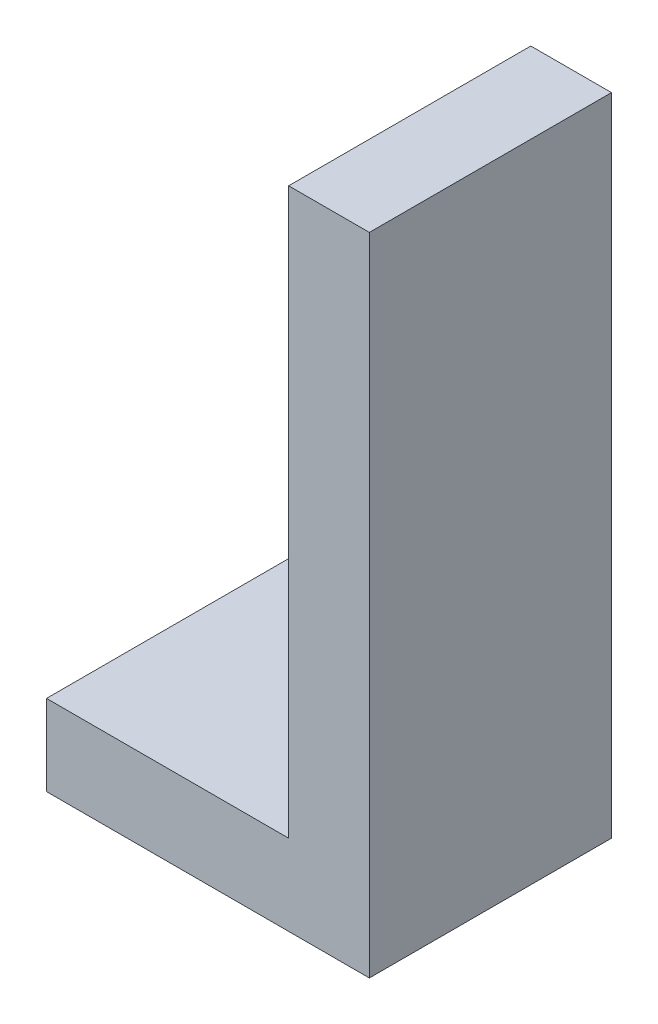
ISO-10303-21;
HEADER;
FILE_DESCRIPTION(('STEP AP214'),'2;1');
FILE_NAME('part.step','',(''),(''),'','','');
FILE_SCHEMA(('AUTOMOTIVE_DESIGN { 1 0 10303 214 1 1 1 1 }'));
ENDSEC;
DATA;
#1=APPLICATION_CONTEXT('core data for automotive mechanical design processes');
#2=APPLICATION_PROTOCOL_DEFINITION('international standard','automotive_design',2000,#1);
#3=PRODUCT_CONTEXT('',#1,'mechanical');
#4=PRODUCT('Part','Part','',(#3));
#5=PRODUCT_RELATED_PRODUCT_CATEGORY('part','',(#4));
#6=PRODUCT_DEFINITION_FORMATION('','',#4);
#7=PRODUCT_DEFINITION_CONTEXT('part definition',#1,'design');
#8=PRODUCT_DEFINITION('design','',#6,#7);
#9=PRODUCT_DEFINITION_SHAPE('','',#8);
#10=(LENGTH_UNIT() NAMED_UNIT(*) SI_UNIT(.MILLI.,.METRE.));
#11=(NAMED_UNIT(*) PLANE_ANGLE_UNIT() SI_UNIT($,.RADIAN.));
#12=(NAMED_UNIT(*) SI_UNIT($,.STERADIAN.) SOLID_ANGLE_UNIT());
#13=UNCERTAINTY_MEASURE_WITH_UNIT(LENGTH_MEASURE(1.E-05),#10,'distance_accuracy_value','');
#14=(GEOMETRIC_REPRESENTATION_CONTEXT(3) GLOBAL_UNCERTAINTY_ASSIGNED_CONTEXT((#13)) GLOBAL_UNIT_ASSIGNED_CONTEXT((#10,
#11,#12)) REPRESENTATION_CONTEXT('',''));
#15=CARTESIAN_POINT('',(0.,0.,0.));
#16=DIRECTION('',(0.,0.,1.));
#17=DIRECTION('',(1.,0.,0.));
#18=AXIS2_PLACEMENT_3D('',#15,#16,#17);
#19=CARTESIAN_POINT('',(15.,40.,0.));
#20=DIRECTION('',(-1.,0.,0.));
#21=DIRECTION('',(0.,0.,1.));
#22=AXIS2_PLACEMENT_3D('',#19,#20,#21);
#23=PLANE('',#22);
#24=DIRECTION('',(0.,0.,1.));
#25=VECTOR('',#24,1.);
#26=CARTESIAN_POINT('',(15.,5.,0.));
#27=LINE('',#26,#25);
#28=CARTESIAN_POINT('',(15.,5.,15.));
#29=VERTEX_POINT('',#28);
#30=CARTESIAN_POINT('',(15.,5.,0.));
#31=VERTEX_POINT('',#30);
#32=EDGE_CURVE('E20',#29,#31,#27,.F.);
#33=ORIENTED_EDGE('',*,*,#32,.F.);
#34=DIRECTION('',(0.,1.,0.));
#35=VECTOR('',#34,1.);
#36=CARTESIAN_POINT('',(15.,0.,15.));
#37=LINE('',#36,#35);
#38=CARTESIAN_POINT('',(15.,40.,15.));
#39=VERTEX_POINT('',#38);
#40=EDGE_CURVE('E114',#39,#29,#37,.F.);
#41=ORIENTED_EDGE('',*,*,#40,.F.);
#42=DIRECTION('',(0.,0.,1.));
#43=VECTOR('',#42,1.);
#44=CARTESIAN_POINT('',(15.,40.,0.));
#45=LINE('',#44,#43);
#46=CARTESIAN_POINT('',(15.,40.,0.));
#47=VERTEX_POINT('',#46);
#48=EDGE_CURVE('E110',#47,#39,#45,.T.);
#49=ORIENTED_EDGE('',*,*,#48,.F.);
#50=DIRECTION('',(0.,1.,0.));
#51=VECTOR('',#50,1.);
#52=CARTESIAN_POINT('',(15.,0.,0.));
#53=LINE('',#52,#51);
#54=EDGE_CURVE('E66',#47,#31,#53,.F.);
#55=ORIENTED_EDGE('',*,*,#54,.T.);
#56=EDGE_LOOP('',(#33,#41,#49,#55));
#57=FACE_BOUND('',#56,.T.);
#58=ADVANCED_FACE('F17',(#57),#23,.T.);
#59=CARTESIAN_POINT('',(15.,5.,0.));
#60=DIRECTION('',(0.,1.,0.));
#61=DIRECTION('',(0.,0.,1.));
#62=AXIS2_PLACEMENT_3D('',#59,#60,#61);
#63=PLANE('',#62);
#64=DIRECTION('',(0.,0.,1.));
#65=VECTOR('',#64,1.);
#66=CARTESIAN_POINT('',(0.,5.,0.));
#67=LINE('',#66,#65);
#68=CARTESIAN_POINT('',(0.,5.,15.));
#69=VERTEX_POINT('',#68);
#70=CARTESIAN_POINT('',(0.,5.,0.));
#71=VERTEX_POINT('',#70);
#72=EDGE_CURVE('E82',#69,#71,#67,.F.);
#73=ORIENTED_EDGE('',*,*,#72,.F.);
#74=DIRECTION('',(1.,0.,0.));
#75=VECTOR('',#74,1.);
#76=CARTESIAN_POINT('',(0.,5.,15.));
#77=LINE('',#76,#75);
#78=EDGE_CURVE('E104',#29,#69,#77,.F.);
#79=ORIENTED_EDGE('',*,*,#78,.F.);
#80=ORIENTED_EDGE('',*,*,#32,.T.);
#81=DIRECTION('',(1.,0.,0.));
#82=VECTOR('',#81,1.);
#83=CARTESIAN_POINT('',(0.,5.,0.));
#84=LINE('',#83,#82);
#85=EDGE_CURVE('E91',#31,#71,#84,.F.);
#86=ORIENTED_EDGE('',*,*,#85,.T.);
#87=EDGE_LOOP('',(#73,#79,#80,#86));
#88=FACE_BOUND('',#87,.T.);
#89=ADVANCED_FACE('F102',(#88),#63,.T.);
#90=CARTESIAN_POINT('',(0.,5.,0.));
#91=DIRECTION('',(-1.,0.,0.));
#92=DIRECTION('',(0.,-1.,0.));
#93=AXIS2_PLACEMENT_3D('',#90,#91,#92);
#94=PLANE('',#93);
#95=DIRECTION('',(0.,0.,-1.));
#96=VECTOR('',#95,1.);
#97=CARTESIAN_POINT('',(0.,0.,0.));
#98=LINE('',#97,#96);
#99=CARTESIAN_POINT('',(0.,0.,15.));
#100=VERTEX_POINT('',#99);
#101=CARTESIAN_POINT('',(0.,0.,0.));
#102=VERTEX_POINT('',#101);
#103=EDGE_CURVE('E71',#100,#102,#98,.T.);
#104=ORIENTED_EDGE('',*,*,#103,.F.);
#105=DIRECTION('',(0.,1.,0.));
#106=VECTOR('',#105,1.);
#107=CARTESIAN_POINT('',(0.,0.,15.));
#108=LINE('',#107,#106);
#109=EDGE_CURVE('E117',#69,#100,#108,.F.);
#110=ORIENTED_EDGE('',*,*,#109,.F.);
#111=ORIENTED_EDGE('',*,*,#72,.T.);
#112=DIRECTION('',(0.,1.,0.));
#113=VECTOR('',#112,1.);
#114=CARTESIAN_POINT('',(0.,0.,0.));
#115=LINE('',#114,#113);
#116=EDGE_CURVE('E86',#71,#102,#115,.F.);
#117=ORIENTED_EDGE('',*,*,#116,.T.);
#118=EDGE_LOOP('',(#104,#110,#111,#117));
#119=FACE_BOUND('',#118,.T.);
#120=ADVANCED_FACE('F87',(#119),#94,.T.);
#121=CARTESIAN_POINT('',(0.,0.,0.));
#122=DIRECTION('',(0.,-1.,0.));
#123=DIRECTION('',(0.,0.,-1.));
#124=AXIS2_PLACEMENT_3D('',#121,#122,#123);
#125=PLANE('',#124);
#126=DIRECTION('',(0.,0.,-1.));
#127=VECTOR('',#126,1.);
#128=CARTESIAN_POINT('',(20.,0.,0.));
#129=LINE('',#128,#127);
#130=CARTESIAN_POINT('',(20.,0.,15.));
#131=VERTEX_POINT('',#130);
#132=CARTESIAN_POINT('',(20.,0.,0.));
#133=VERTEX_POINT('',#132);
#134=EDGE_CURVE('E119',#131,#133,#129,.T.);
#135=ORIENTED_EDGE('',*,*,#134,.F.);
#136=DIRECTION('',(1.,0.,0.));
#137=VECTOR('',#136,1.);
#138=CARTESIAN_POINT('',(0.,0.,15.));
#139=LINE('',#138,#137);
#140=EDGE_CURVE('E78',#100,#131,#139,.T.);
#141=ORIENTED_EDGE('',*,*,#140,.F.);
#142=ORIENTED_EDGE('',*,*,#103,.T.);
#143=DIRECTION('',(1.,0.,0.));
#144=VECTOR('',#143,1.);
#145=CARTESIAN_POINT('',(0.,0.,0.));
#146=LINE('',#145,#144);
#147=EDGE_CURVE('E75',#102,#133,#146,.T.);
#148=ORIENTED_EDGE('',*,*,#147,.T.);
#149=EDGE_LOOP('',(#135,#141,#142,#148));
#150=FACE_BOUND('',#149,.T.);
#151=ADVANCED_FACE('F73',(#150),#125,.T.);
#152=CARTESIAN_POINT('',(0.,0.,0.));
#153=DIRECTION('',(0.,0.,1.));
#154=DIRECTION('',(1.,0.,0.));
#155=AXIS2_PLACEMENT_3D('',#152,#153,#154);
#156=PLANE('',#155);
#157=ORIENTED_EDGE('',*,*,#85,.F.);
#158=ORIENTED_EDGE('',*,*,#54,.F.);
#159=DIRECTION('',(1.,0.,0.));
#160=VECTOR('',#159,1.);
#161=CARTESIAN_POINT('',(20.,40.,0.));
#162=LINE('',#161,#160);
#163=CARTESIAN_POINT('',(20.,40.,0.));
#164=VERTEX_POINT('',#163);
#165=EDGE_CURVE('E90',#164,#47,#162,.F.);
#166=ORIENTED_EDGE('',*,*,#165,.F.);
#167=DIRECTION('',(0.,1.,0.));
#168=VECTOR('',#167,1.);
#169=CARTESIAN_POINT('',(20.,0.,0.));
#170=LINE('',#169,#168);
#171=EDGE_CURVE('E95',#133,#164,#170,.T.);
#172=ORIENTED_EDGE('',*,*,#171,.F.);
#173=ORIENTED_EDGE('',*,*,#147,.F.);
#174=ORIENTED_EDGE('',*,*,#116,.F.);
#175=EDGE_LOOP('',(#157,#158,#166,#172,#173,#174));
#176=FACE_BOUND('',#175,.T.);
#177=ADVANCED_FACE('F93',(#176),#156,.F.);
#178=CARTESIAN_POINT('',(20.,40.,0.));
#179=DIRECTION('',(0.,1.,0.));
#180=DIRECTION('',(0.,0.,1.));
#181=AXIS2_PLACEMENT_3D('',#178,#179,#180);
#182=PLANE('',#181);
#183=ORIENTED_EDGE('',*,*,#48,.T.);
#184=DIRECTION('',(1.,0.,0.));
#185=VECTOR('',#184,1.);
#186=CARTESIAN_POINT('',(0.,40.,15.));
#187=LINE('',#186,#185);
#188=CARTESIAN_POINT('',(20.,40.,15.));
#189=VERTEX_POINT('',#188);
#190=EDGE_CURVE('E35',#189,#39,#187,.F.);
#191=ORIENTED_EDGE('',*,*,#190,.F.);
#192=DIRECTION('',(0.,0.,-1.));
#193=VECTOR('',#192,1.);
#194=CARTESIAN_POINT('',(20.,40.,0.));
#195=LINE('',#194,#193);
#196=EDGE_CURVE('E26',#164,#189,#195,.F.);
#197=ORIENTED_EDGE('',*,*,#196,.F.);
#198=ORIENTED_EDGE('',*,*,#165,.T.);
#199=EDGE_LOOP('',(#183,#191,#197,#198));
#200=FACE_BOUND('',#199,.T.);
#201=ADVANCED_FACE('F125',(#200),#182,.T.);
#202=CARTESIAN_POINT('',(0.,0.,15.));
#203=DIRECTION('',(0.,0.,1.));
#204=DIRECTION('',(1.,0.,0.));
#205=AXIS2_PLACEMENT_3D('',#202,#203,#204);
#206=PLANE('',#205);
#207=ORIENTED_EDGE('',*,*,#78,.T.);
#208=ORIENTED_EDGE('',*,*,#109,.T.);
#209=ORIENTED_EDGE('',*,*,#140,.T.);
#210=DIRECTION('',(0.,1.,0.));
#211=VECTOR('',#210,1.);
#212=CARTESIAN_POINT('',(20.,0.,15.));
#213=LINE('',#212,#211);
#214=EDGE_CURVE('E11',#189,#131,#213,.F.);
#215=ORIENTED_EDGE('',*,*,#214,.F.);
#216=ORIENTED_EDGE('',*,*,#190,.T.);
#217=ORIENTED_EDGE('',*,*,#40,.T.);
#218=EDGE_LOOP('',(#207,#208,#209,#215,#216,#217));
#219=FACE_BOUND('',#218,.T.);
#220=ADVANCED_FACE('F127',(#219),#206,.T.);
#221=CARTESIAN_POINT('',(20.,0.,0.));
#222=DIRECTION('',(1.,0.,0.));
#223=DIRECTION('',(0.,0.,-1.));
#224=AXIS2_PLACEMENT_3D('',#221,#222,#223);
#225=PLANE('',#224);
#226=ORIENTED_EDGE('',*,*,#196,.T.);
#227=ORIENTED_EDGE('',*,*,#214,.T.);
#228=ORIENTED_EDGE('',*,*,#134,.T.);
#229=ORIENTED_EDGE('',*,*,#171,.T.);
#230=EDGE_LOOP('',(#226,#227,#228,#229));
#231=FACE_BOUND('',#230,.T.);
#232=ADVANCED_FACE('F124',(#231),#225,.T.);
#233=CLOSED_SHELL('',(#58,#89,#120,#151,#177,#201,#220,#232));
#234=MANIFOLD_SOLID_BREP('B1',#233);
#235=ADVANCED_BREP_SHAPE_REPRESENTATION('',(#18,#234),#14);
#236=SHAPE_DEFINITION_REPRESENTATION(#9,#235);
ENDSEC;
END-ISO-10303-21;
